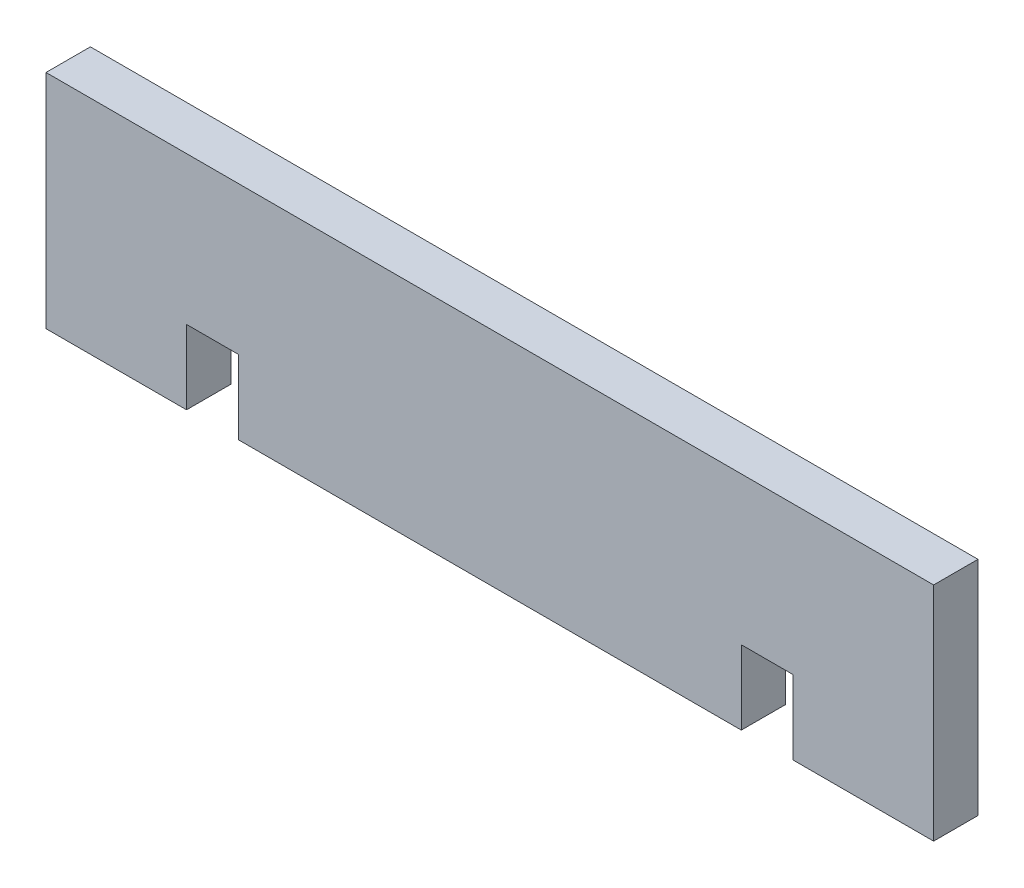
ISO-10303-21;
HEADER;
FILE_DESCRIPTION(('STEP AP214'),'2;1');
FILE_NAME('part.step','',(''),(''),'','','');
FILE_SCHEMA(('AUTOMOTIVE_DESIGN { 1 0 10303 214 1 1 1 1 }'));
ENDSEC;
DATA;
#1=APPLICATION_CONTEXT('core data for automotive mechanical design processes');
#2=APPLICATION_PROTOCOL_DEFINITION('international standard','automotive_design',2000,#1);
#3=PRODUCT_CONTEXT('',#1,'mechanical');
#4=PRODUCT('Part','Part','',(#3));
#5=PRODUCT_RELATED_PRODUCT_CATEGORY('part','',(#4));
#6=PRODUCT_DEFINITION_FORMATION('','',#4);
#7=PRODUCT_DEFINITION_CONTEXT('part definition',#1,'design');
#8=PRODUCT_DEFINITION('design','',#6,#7);
#9=PRODUCT_DEFINITION_SHAPE('','',#8);
#10=(LENGTH_UNIT() NAMED_UNIT(*) SI_UNIT(.MILLI.,.METRE.));
#11=(NAMED_UNIT(*) PLANE_ANGLE_UNIT() SI_UNIT($,.RADIAN.));
#12=(NAMED_UNIT(*) SI_UNIT($,.STERADIAN.) SOLID_ANGLE_UNIT());
#13=UNCERTAINTY_MEASURE_WITH_UNIT(LENGTH_MEASURE(1.E-05),#10,'distance_accuracy_value','');
#14=(GEOMETRIC_REPRESENTATION_CONTEXT(3) GLOBAL_UNCERTAINTY_ASSIGNED_CONTEXT((#13)) GLOBAL_UNIT_ASSIGNED_CONTEXT((#10,
#11,#12)) REPRESENTATION_CONTEXT('',''));
#15=CARTESIAN_POINT('',(0.,0.,0.));
#16=DIRECTION('',(0.,0.,1.));
#17=DIRECTION('',(1.,0.,0.));
#18=AXIS2_PLACEMENT_3D('',#15,#16,#17);
#19=CARTESIAN_POINT('',(0.,0.,3.));
#20=DIRECTION('',(0.,1.,0.));
#21=DIRECTION('',(0.,0.,1.));
#22=AXIS2_PLACEMENT_3D('',#19,#20,#21);
#23=PLANE('',#22);
#24=DIRECTION('',(1.,0.,0.));
#25=VECTOR('',#24,1.);
#26=CARTESIAN_POINT('',(0.,0.,0.));
#27=LINE('',#26,#25);
#28=CARTESIAN_POINT('',(13.,0.,0.));
#29=VERTEX_POINT('',#28);
#30=CARTESIAN_POINT('',(47.,0.,0.));
#31=VERTEX_POINT('',#30);
#32=EDGE_CURVE('E136',#29,#31,#27,.T.);
#33=ORIENTED_EDGE('',*,*,#32,.T.);
#34=DIRECTION('',(0.,0.,1.));
#35=VECTOR('',#34,1.);
#36=CARTESIAN_POINT('',(47.,0.,0.));
#37=LINE('',#36,#35);
#38=CARTESIAN_POINT('',(47.,0.,3.));
#39=VERTEX_POINT('',#38);
#40=EDGE_CURVE('E120',#31,#39,#37,.T.);
#41=ORIENTED_EDGE('',*,*,#40,.T.);
#42=DIRECTION('',(1.,0.,0.));
#43=VECTOR('',#42,1.);
#44=CARTESIAN_POINT('',(0.,0.,3.));
#45=LINE('',#44,#43);
#46=CARTESIAN_POINT('',(13.,0.,3.));
#47=VERTEX_POINT('',#46);
#48=EDGE_CURVE('E188',#47,#39,#45,.T.);
#49=ORIENTED_EDGE('',*,*,#48,.F.);
#50=DIRECTION('',(0.,0.,1.));
#51=VECTOR('',#50,1.);
#52=CARTESIAN_POINT('',(13.,0.,0.));
#53=LINE('',#52,#51);
#54=EDGE_CURVE('E142',#29,#47,#53,.T.);
#55=ORIENTED_EDGE('',*,*,#54,.F.);
#56=EDGE_LOOP('',(#33,#41,#49,#55));
#57=FACE_BOUND('',#56,.T.);
#58=ADVANCED_FACE('F31',(#57),#23,.F.);
#59=CARTESIAN_POINT('',(0.,0.,0.));
#60=VERTEX_POINT('',#59);
#61=CARTESIAN_POINT('',(9.5,0.,0.));
#62=VERTEX_POINT('',#61);
#63=EDGE_CURVE('E143',#60,#62,#27,.T.);
#64=ORIENTED_EDGE('',*,*,#63,.T.);
#65=DIRECTION('',(0.,0.,1.));
#66=VECTOR('',#65,1.);
#67=CARTESIAN_POINT('',(9.5,0.,0.));
#68=LINE('',#67,#66);
#69=CARTESIAN_POINT('',(9.5,0.,3.));
#70=VERTEX_POINT('',#69);
#71=EDGE_CURVE('E192',#62,#70,#68,.T.);
#72=ORIENTED_EDGE('',*,*,#71,.T.);
#73=CARTESIAN_POINT('',(0.,0.,3.));
#74=VERTEX_POINT('',#73);
#75=EDGE_CURVE('E190',#74,#70,#45,.T.);
#76=ORIENTED_EDGE('',*,*,#75,.F.);
#77=DIRECTION('',(0.,0.,-1.));
#78=VECTOR('',#77,1.);
#79=CARTESIAN_POINT('',(0.,0.,3.));
#80=LINE('',#79,#78);
#81=EDGE_CURVE('E11',#74,#60,#80,.T.);
#82=ORIENTED_EDGE('',*,*,#81,.T.);
#83=EDGE_LOOP('',(#64,#72,#76,#82));
#84=FACE_BOUND('',#83,.T.);
#85=ADVANCED_FACE('F230',(#84),#23,.F.);
#86=CARTESIAN_POINT('',(0.,0.,3.));
#87=DIRECTION('',(1.,0.,0.));
#88=DIRECTION('',(0.,0.,-1.));
#89=AXIS2_PLACEMENT_3D('',#86,#87,#88);
#90=PLANE('',#89);
#91=DIRECTION('',(0.,-1.,0.));
#92=VECTOR('',#91,1.);
#93=CARTESIAN_POINT('',(0.,0.,0.));
#94=LINE('',#93,#92);
#95=CARTESIAN_POINT('',(0.,15.,0.));
#96=VERTEX_POINT('',#95);
#97=EDGE_CURVE('E148',#96,#60,#94,.T.);
#98=ORIENTED_EDGE('',*,*,#97,.T.);
#99=ORIENTED_EDGE('',*,*,#81,.F.);
#100=DIRECTION('',(0.,-1.,0.));
#101=VECTOR('',#100,1.);
#102=CARTESIAN_POINT('',(0.,0.,3.));
#103=LINE('',#102,#101);
#104=CARTESIAN_POINT('',(0.,15.,3.));
#105=VERTEX_POINT('',#104);
#106=EDGE_CURVE('E155',#105,#74,#103,.T.);
#107=ORIENTED_EDGE('',*,*,#106,.F.);
#108=DIRECTION('',(0.,0.,-1.));
#109=VECTOR('',#108,1.);
#110=CARTESIAN_POINT('',(0.,15.,3.));
#111=LINE('',#110,#109);
#112=EDGE_CURVE('E156',#105,#96,#111,.T.);
#113=ORIENTED_EDGE('',*,*,#112,.T.);
#114=EDGE_LOOP('',(#98,#99,#107,#113));
#115=FACE_BOUND('',#114,.T.);
#116=ADVANCED_FACE('F33',(#115),#90,.F.);
#117=CARTESIAN_POINT('',(50.5,0.,3.));
#118=VERTEX_POINT('',#117);
#119=CARTESIAN_POINT('',(60.,0.,3.));
#120=VERTEX_POINT('',#119);
#121=EDGE_CURVE('E186',#118,#120,#45,.T.);
#122=ORIENTED_EDGE('',*,*,#121,.F.);
#123=DIRECTION('',(0.,0.,1.));
#124=VECTOR('',#123,1.);
#125=CARTESIAN_POINT('',(50.5,0.,0.));
#126=LINE('',#125,#124);
#127=CARTESIAN_POINT('',(50.5,0.,0.));
#128=VERTEX_POINT('',#127);
#129=EDGE_CURVE('E130',#128,#118,#126,.T.);
#130=ORIENTED_EDGE('',*,*,#129,.F.);
#131=CARTESIAN_POINT('',(60.,0.,0.));
#132=VERTEX_POINT('',#131);
#133=EDGE_CURVE('E144',#128,#132,#27,.T.);
#134=ORIENTED_EDGE('',*,*,#133,.T.);
#135=DIRECTION('',(0.,0.,-1.));
#136=VECTOR('',#135,1.);
#137=CARTESIAN_POINT('',(60.,0.,3.));
#138=LINE('',#137,#136);
#139=EDGE_CURVE('E39',#120,#132,#138,.T.);
#140=ORIENTED_EDGE('',*,*,#139,.F.);
#141=EDGE_LOOP('',(#122,#130,#134,#140));
#142=FACE_BOUND('',#141,.T.);
#143=ADVANCED_FACE('F201',(#142),#23,.F.);
#144=CARTESIAN_POINT('',(60.,0.,3.));
#145=DIRECTION('',(-1.,0.,0.));
#146=DIRECTION('',(0.,0.,1.));
#147=AXIS2_PLACEMENT_3D('',#144,#145,#146);
#148=PLANE('',#147);
#149=DIRECTION('',(0.,1.,0.));
#150=VECTOR('',#149,1.);
#151=CARTESIAN_POINT('',(60.,0.,0.));
#152=LINE('',#151,#150);
#153=CARTESIAN_POINT('',(60.,15.,0.));
#154=VERTEX_POINT('',#153);
#155=EDGE_CURVE('E147',#132,#154,#152,.T.);
#156=ORIENTED_EDGE('',*,*,#155,.T.);
#157=DIRECTION('',(0.,0.,-1.));
#158=VECTOR('',#157,1.);
#159=CARTESIAN_POINT('',(60.,15.,3.));
#160=LINE('',#159,#158);
#161=CARTESIAN_POINT('',(60.,15.,3.));
#162=VERTEX_POINT('',#161);
#163=EDGE_CURVE('E159',#162,#154,#160,.T.);
#164=ORIENTED_EDGE('',*,*,#163,.F.);
#165=DIRECTION('',(0.,1.,0.));
#166=VECTOR('',#165,1.);
#167=CARTESIAN_POINT('',(60.,0.,3.));
#168=LINE('',#167,#166);
#169=EDGE_CURVE('E169',#120,#162,#168,.T.);
#170=ORIENTED_EDGE('',*,*,#169,.F.);
#171=ORIENTED_EDGE('',*,*,#139,.T.);
#172=EDGE_LOOP('',(#156,#164,#170,#171));
#173=FACE_BOUND('',#172,.T.);
#174=ADVANCED_FACE('F167',(#173),#148,.F.);
#175=CARTESIAN_POINT('',(0.,15.,3.));
#176=DIRECTION('',(0.,-1.,0.));
#177=DIRECTION('',(0.,0.,-1.));
#178=AXIS2_PLACEMENT_3D('',#175,#176,#177);
#179=PLANE('',#178);
#180=DIRECTION('',(-1.,0.,0.));
#181=VECTOR('',#180,1.);
#182=CARTESIAN_POINT('',(0.,15.,0.));
#183=LINE('',#182,#181);
#184=EDGE_CURVE('E153',#154,#96,#183,.T.);
#185=ORIENTED_EDGE('',*,*,#184,.T.);
#186=ORIENTED_EDGE('',*,*,#112,.F.);
#187=DIRECTION('',(-1.,0.,0.));
#188=VECTOR('',#187,1.);
#189=CARTESIAN_POINT('',(0.,15.,3.));
#190=LINE('',#189,#188);
#191=EDGE_CURVE('E160',#162,#105,#190,.T.);
#192=ORIENTED_EDGE('',*,*,#191,.F.);
#193=ORIENTED_EDGE('',*,*,#163,.T.);
#194=EDGE_LOOP('',(#185,#186,#192,#193));
#195=FACE_BOUND('',#194,.T.);
#196=ADVANCED_FACE('F178',(#195),#179,.F.);
#197=CARTESIAN_POINT('',(0.,15.,3.));
#198=DIRECTION('',(0.,0.,-1.));
#199=DIRECTION('',(-1.,0.,0.));
#200=AXIS2_PLACEMENT_3D('',#197,#198,#199);
#201=PLANE('',#200);
#202=ORIENTED_EDGE('',*,*,#48,.T.);
#203=DIRECTION('',(0.,-1.,0.));
#204=VECTOR('',#203,1.);
#205=CARTESIAN_POINT('',(47.,0.,3.));
#206=LINE('',#205,#204);
#207=CARTESIAN_POINT('',(47.,5.,3.));
#208=VERTEX_POINT('',#207);
#209=EDGE_CURVE('E125',#208,#39,#206,.T.);
#210=ORIENTED_EDGE('',*,*,#209,.F.);
#211=DIRECTION('',(-1.,0.,0.));
#212=VECTOR('',#211,1.);
#213=CARTESIAN_POINT('',(47.,5.,3.));
#214=LINE('',#213,#212);
#215=CARTESIAN_POINT('',(50.5,5.,3.));
#216=VERTEX_POINT('',#215);
#217=EDGE_CURVE('E139',#216,#208,#214,.T.);
#218=ORIENTED_EDGE('',*,*,#217,.F.);
#219=DIRECTION('',(0.,1.,0.));
#220=VECTOR('',#219,1.);
#221=CARTESIAN_POINT('',(50.5,0.,3.));
#222=LINE('',#221,#220);
#223=EDGE_CURVE('E199',#118,#216,#222,.T.);
#224=ORIENTED_EDGE('',*,*,#223,.F.);
#225=ORIENTED_EDGE('',*,*,#121,.T.);
#226=ORIENTED_EDGE('',*,*,#169,.T.);
#227=ORIENTED_EDGE('',*,*,#191,.T.);
#228=ORIENTED_EDGE('',*,*,#106,.T.);
#229=ORIENTED_EDGE('',*,*,#75,.T.);
#230=DIRECTION('',(0.,-1.,0.));
#231=VECTOR('',#230,1.);
#232=CARTESIAN_POINT('',(9.5,0.,3.));
#233=LINE('',#232,#231);
#234=CARTESIAN_POINT('',(9.5,5.,3.));
#235=VERTEX_POINT('',#234);
#236=EDGE_CURVE('E216',#235,#70,#233,.T.);
#237=ORIENTED_EDGE('',*,*,#236,.F.);
#238=DIRECTION('',(-1.,0.,0.));
#239=VECTOR('',#238,1.);
#240=CARTESIAN_POINT('',(9.5,5.,3.));
#241=LINE('',#240,#239);
#242=CARTESIAN_POINT('',(13.,5.,3.));
#243=VERTEX_POINT('',#242);
#244=EDGE_CURVE('E213',#243,#235,#241,.T.);
#245=ORIENTED_EDGE('',*,*,#244,.F.);
#246=DIRECTION('',(0.,1.,0.));
#247=VECTOR('',#246,1.);
#248=CARTESIAN_POINT('',(13.,0.,3.));
#249=LINE('',#248,#247);
#250=EDGE_CURVE('E218',#47,#243,#249,.T.);
#251=ORIENTED_EDGE('',*,*,#250,.F.);
#252=EDGE_LOOP('',(#202,#210,#218,#224,#225,#226,#227,#228,#229,#237,#245,#251));
#253=FACE_BOUND('',#252,.T.);
#254=ADVANCED_FACE('F195',(#253),#201,.F.);
#255=CARTESIAN_POINT('',(0.,15.,0.));
#256=DIRECTION('',(0.,0.,-1.));
#257=DIRECTION('',(-1.,0.,0.));
#258=AXIS2_PLACEMENT_3D('',#255,#256,#257);
#259=PLANE('',#258);
#260=DIRECTION('',(0.,-1.,0.));
#261=VECTOR('',#260,1.);
#262=CARTESIAN_POINT('',(47.,0.,0.));
#263=LINE('',#262,#261);
#264=CARTESIAN_POINT('',(47.,5.,0.));
#265=VERTEX_POINT('',#264);
#266=EDGE_CURVE('E123',#265,#31,#263,.T.);
#267=ORIENTED_EDGE('',*,*,#266,.T.);
#268=ORIENTED_EDGE('',*,*,#32,.F.);
#269=DIRECTION('',(0.,1.,0.));
#270=VECTOR('',#269,1.);
#271=CARTESIAN_POINT('',(13.,0.,0.));
#272=LINE('',#271,#270);
#273=CARTESIAN_POINT('',(13.,5.,0.));
#274=VERTEX_POINT('',#273);
#275=EDGE_CURVE('E212',#29,#274,#272,.T.);
#276=ORIENTED_EDGE('',*,*,#275,.T.);
#277=DIRECTION('',(-1.,0.,0.));
#278=VECTOR('',#277,1.);
#279=CARTESIAN_POINT('',(9.5,5.,0.));
#280=LINE('',#279,#278);
#281=CARTESIAN_POINT('',(9.5,5.,0.));
#282=VERTEX_POINT('',#281);
#283=EDGE_CURVE('E54',#274,#282,#280,.T.);
#284=ORIENTED_EDGE('',*,*,#283,.T.);
#285=DIRECTION('',(0.,-1.,0.));
#286=VECTOR('',#285,1.);
#287=CARTESIAN_POINT('',(9.5,0.,0.));
#288=LINE('',#287,#286);
#289=EDGE_CURVE('E209',#282,#62,#288,.T.);
#290=ORIENTED_EDGE('',*,*,#289,.T.);
#291=ORIENTED_EDGE('',*,*,#63,.F.);
#292=ORIENTED_EDGE('',*,*,#97,.F.);
#293=ORIENTED_EDGE('',*,*,#184,.F.);
#294=ORIENTED_EDGE('',*,*,#155,.F.);
#295=ORIENTED_EDGE('',*,*,#133,.F.);
#296=DIRECTION('',(0.,1.,0.));
#297=VECTOR('',#296,1.);
#298=CARTESIAN_POINT('',(50.5,0.,0.));
#299=LINE('',#298,#297);
#300=CARTESIAN_POINT('',(50.5,5.,0.));
#301=VERTEX_POINT('',#300);
#302=EDGE_CURVE('E138',#128,#301,#299,.T.);
#303=ORIENTED_EDGE('',*,*,#302,.T.);
#304=DIRECTION('',(-1.,0.,0.));
#305=VECTOR('',#304,1.);
#306=CARTESIAN_POINT('',(47.,5.,0.));
#307=LINE('',#306,#305);
#308=EDGE_CURVE('E46',#301,#265,#307,.T.);
#309=ORIENTED_EDGE('',*,*,#308,.T.);
#310=EDGE_LOOP('',(#267,#268,#276,#284,#290,#291,#292,#293,#294,#295,#303,#309));
#311=FACE_BOUND('',#310,.T.);
#312=ADVANCED_FACE('F134',(#311),#259,.T.);
#313=CARTESIAN_POINT('',(9.5,0.,0.));
#314=DIRECTION('',(-1.,0.,0.));
#315=DIRECTION('',(0.,0.,1.));
#316=AXIS2_PLACEMENT_3D('',#313,#314,#315);
#317=PLANE('',#316);
#318=ORIENTED_EDGE('',*,*,#236,.T.);
#319=ORIENTED_EDGE('',*,*,#71,.F.);
#320=ORIENTED_EDGE('',*,*,#289,.F.);
#321=DIRECTION('',(0.,0.,1.));
#322=VECTOR('',#321,1.);
#323=CARTESIAN_POINT('',(9.5,5.,0.));
#324=LINE('',#323,#322);
#325=EDGE_CURVE('E223',#282,#235,#324,.T.);
#326=ORIENTED_EDGE('',*,*,#325,.T.);
#327=EDGE_LOOP('',(#318,#319,#320,#326));
#328=FACE_BOUND('',#327,.T.);
#329=ADVANCED_FACE('F235',(#328),#317,.F.);
#330=CARTESIAN_POINT('',(9.5,5.,0.));
#331=DIRECTION('',(0.,1.,0.));
#332=DIRECTION('',(0.,0.,1.));
#333=AXIS2_PLACEMENT_3D('',#330,#331,#332);
#334=PLANE('',#333);
#335=ORIENTED_EDGE('',*,*,#244,.T.);
#336=ORIENTED_EDGE('',*,*,#325,.F.);
#337=ORIENTED_EDGE('',*,*,#283,.F.);
#338=DIRECTION('',(0.,0.,1.));
#339=VECTOR('',#338,1.);
#340=CARTESIAN_POINT('',(13.,5.,0.));
#341=LINE('',#340,#339);
#342=EDGE_CURVE('E225',#274,#243,#341,.T.);
#343=ORIENTED_EDGE('',*,*,#342,.T.);
#344=EDGE_LOOP('',(#335,#336,#337,#343));
#345=FACE_BOUND('',#344,.T.);
#346=ADVANCED_FACE('F236',(#345),#334,.F.);
#347=CARTESIAN_POINT('',(13.,0.,0.));
#348=DIRECTION('',(1.,0.,0.));
#349=DIRECTION('',(0.,0.,-1.));
#350=AXIS2_PLACEMENT_3D('',#347,#348,#349);
#351=PLANE('',#350);
#352=ORIENTED_EDGE('',*,*,#250,.T.);
#353=ORIENTED_EDGE('',*,*,#342,.F.);
#354=ORIENTED_EDGE('',*,*,#275,.F.);
#355=ORIENTED_EDGE('',*,*,#54,.T.);
#356=EDGE_LOOP('',(#352,#353,#354,#355));
#357=FACE_BOUND('',#356,.T.);
#358=ADVANCED_FACE('F237',(#357),#351,.F.);
#359=CARTESIAN_POINT('',(47.,0.,0.));
#360=DIRECTION('',(-1.,0.,0.));
#361=DIRECTION('',(0.,0.,1.));
#362=AXIS2_PLACEMENT_3D('',#359,#360,#361);
#363=PLANE('',#362);
#364=ORIENTED_EDGE('',*,*,#209,.T.);
#365=ORIENTED_EDGE('',*,*,#40,.F.);
#366=ORIENTED_EDGE('',*,*,#266,.F.);
#367=DIRECTION('',(0.,0.,1.));
#368=VECTOR('',#367,1.);
#369=CARTESIAN_POINT('',(47.,5.,0.));
#370=LINE('',#369,#368);
#371=EDGE_CURVE('E205',#265,#208,#370,.T.);
#372=ORIENTED_EDGE('',*,*,#371,.T.);
#373=EDGE_LOOP('',(#364,#365,#366,#372));
#374=FACE_BOUND('',#373,.T.);
#375=ADVANCED_FACE('F122',(#374),#363,.F.);
#376=CARTESIAN_POINT('',(47.,5.,0.));
#377=DIRECTION('',(0.,1.,0.));
#378=DIRECTION('',(0.,0.,1.));
#379=AXIS2_PLACEMENT_3D('',#376,#377,#378);
#380=PLANE('',#379);
#381=ORIENTED_EDGE('',*,*,#217,.T.);
#382=ORIENTED_EDGE('',*,*,#371,.F.);
#383=ORIENTED_EDGE('',*,*,#308,.F.);
#384=DIRECTION('',(0.,0.,1.));
#385=VECTOR('',#384,1.);
#386=CARTESIAN_POINT('',(50.5,5.,0.));
#387=LINE('',#386,#385);
#388=EDGE_CURVE('E203',#301,#216,#387,.T.);
#389=ORIENTED_EDGE('',*,*,#388,.T.);
#390=EDGE_LOOP('',(#381,#382,#383,#389));
#391=FACE_BOUND('',#390,.T.);
#392=ADVANCED_FACE('F244',(#391),#380,.F.);
#393=CARTESIAN_POINT('',(50.5,0.,0.));
#394=DIRECTION('',(1.,0.,0.));
#395=DIRECTION('',(0.,0.,-1.));
#396=AXIS2_PLACEMENT_3D('',#393,#394,#395);
#397=PLANE('',#396);
#398=ORIENTED_EDGE('',*,*,#223,.T.);
#399=ORIENTED_EDGE('',*,*,#388,.F.);
#400=ORIENTED_EDGE('',*,*,#302,.F.);
#401=ORIENTED_EDGE('',*,*,#129,.T.);
#402=EDGE_LOOP('',(#398,#399,#400,#401));
#403=FACE_BOUND('',#402,.T.);
#404=ADVANCED_FACE('F245',(#403),#397,.F.);
#405=CLOSED_SHELL('',(#58,#85,#116,#143,#174,#196,#254,#312,#329,#346,#358,#375,#392,#404));
#406=MANIFOLD_SOLID_BREP('B2',#405);
#407=ADVANCED_BREP_SHAPE_REPRESENTATION('',(#18,#406),#14);
#408=SHAPE_DEFINITION_REPRESENTATION(#9,#407);
ENDSEC;
END-ISO-10303-21;
